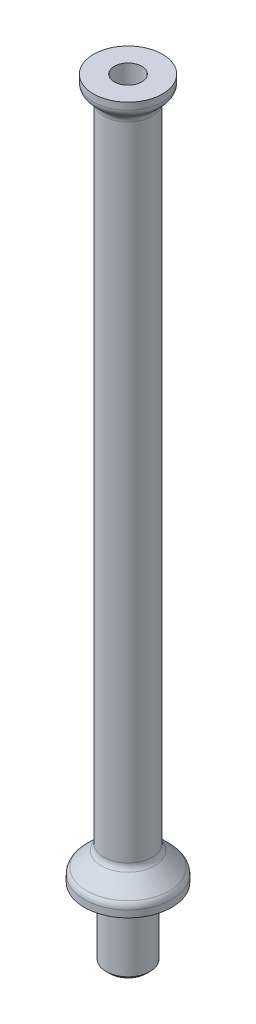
ISO-10303-21;
HEADER;
FILE_DESCRIPTION(('STEP AP214'),'2;1');
FILE_NAME('part.step','',(''),(''),'','','');
FILE_SCHEMA(('AUTOMOTIVE_DESIGN { 1 0 10303 214 1 1 1 1 }'));
ENDSEC;
DATA;
#1=APPLICATION_CONTEXT('core data for automotive mechanical design processes');
#2=APPLICATION_PROTOCOL_DEFINITION('international standard','automotive_design',2000,#1);
#3=PRODUCT_CONTEXT('',#1,'mechanical');
#4=PRODUCT('Part','Part','',(#3));
#5=PRODUCT_RELATED_PRODUCT_CATEGORY('part','',(#4));
#6=PRODUCT_DEFINITION_FORMATION('','',#4);
#7=PRODUCT_DEFINITION_CONTEXT('part definition',#1,'design');
#8=PRODUCT_DEFINITION('design','',#6,#7);
#9=PRODUCT_DEFINITION_SHAPE('','',#8);
#10=(LENGTH_UNIT() NAMED_UNIT(*) SI_UNIT(.MILLI.,.METRE.));
#11=(NAMED_UNIT(*) PLANE_ANGLE_UNIT() SI_UNIT($,.RADIAN.));
#12=(NAMED_UNIT(*) SI_UNIT($,.STERADIAN.) SOLID_ANGLE_UNIT());
#13=UNCERTAINTY_MEASURE_WITH_UNIT(LENGTH_MEASURE(1.E-05),#10,'distance_accuracy_value','');
#14=(GEOMETRIC_REPRESENTATION_CONTEXT(3) GLOBAL_UNCERTAINTY_ASSIGNED_CONTEXT((#13)) GLOBAL_UNIT_ASSIGNED_CONTEXT((#10,
#11,#12)) REPRESENTATION_CONTEXT('',''));
#15=CARTESIAN_POINT('',(0.,0.,0.));
#16=DIRECTION('',(0.,0.,1.));
#17=DIRECTION('',(1.,0.,0.));
#18=AXIS2_PLACEMENT_3D('',#15,#16,#17);
#19=CARTESIAN_POINT('',(-6.90372,0.,0.));
#20=DIRECTION('',(0.,1.,0.));
#21=DIRECTION('',(0.,0.,1.));
#22=AXIS2_PLACEMENT_3D('',#19,#20,#21);
#23=PLANE('',#22);
#24=CARTESIAN_POINT('',(0.,0.,0.));
#25=DIRECTION('',(0.,1.,0.));
#26=DIRECTION('',(0.,0.,1.));
#27=AXIS2_PLACEMENT_3D('',#24,#25,#26);
#28=CIRCLE('',#27,8.3947);
#29=CARTESIAN_POINT('',(0.,0.,8.3947));
#30=VERTEX_POINT('',#29);
#31=EDGE_CURVE('E81',#30,#30,#28,.F.);
#32=ORIENTED_EDGE('',*,*,#31,.T.);
#33=EDGE_LOOP('',(#32));
#34=FACE_BOUND('',#33,.T.);
#35=CARTESIAN_POINT('',(0.,0.,0.));
#36=DIRECTION('',(0.,-1.,0.));
#37=DIRECTION('',(0.,0.,-1.));
#38=AXIS2_PLACEMENT_3D('',#35,#36,#37);
#39=CIRCLE('',#38,6.90372);
#40=CARTESIAN_POINT('',(0.,0.,-6.90372));
#41=VERTEX_POINT('',#40);
#42=EDGE_CURVE('E93',#41,#41,#39,.T.);
#43=ORIENTED_EDGE('',*,*,#42,.F.);
#44=EDGE_LOOP('',(#43));
#45=FACE_BOUND('',#44,.T.);
#46=ADVANCED_FACE('F37',(#34,#45),#23,.F.);
#47=CARTESIAN_POINT('',(-7.9375,-25.4,0.));
#48=DIRECTION('',(0.,1.,0.));
#49=DIRECTION('',(0.,0.,1.));
#50=AXIS2_PLACEMENT_3D('',#47,#48,#49);
#51=PLANE('',#50);
#52=CARTESIAN_POINT('',(0.,-25.4,0.));
#53=DIRECTION('',(0.,1.,0.));
#54=DIRECTION('',(0.,0.,1.));
#55=AXIS2_PLACEMENT_3D('',#52,#53,#54);
#56=CIRCLE('',#55,6.66749999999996);
#57=CARTESIAN_POINT('',(0.,-25.4,6.66749999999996));
#58=VERTEX_POINT('',#57);
#59=EDGE_CURVE('E44',#58,#58,#56,.F.);
#60=ORIENTED_EDGE('',*,*,#59,.T.);
#61=EDGE_LOOP('',(#60));
#62=FACE_BOUND('',#61,.T.);
#63=CARTESIAN_POINT('',(0.,-25.4,0.));
#64=DIRECTION('',(0.,1.,0.));
#65=DIRECTION('',(0.,0.,1.));
#66=AXIS2_PLACEMENT_3D('',#63,#64,#65);
#67=CIRCLE('',#66,4.96061999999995);
#68=CARTESIAN_POINT('',(0.,-25.4,4.96061999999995));
#69=VERTEX_POINT('',#68);
#70=EDGE_CURVE('E102',#69,#69,#67,.T.);
#71=ORIENTED_EDGE('',*,*,#70,.T.);
#72=EDGE_LOOP('',(#71));
#73=FACE_BOUND('',#72,.T.);
#74=ADVANCED_FACE('F142',(#62,#73),#51,.F.);
#75=CARTESIAN_POINT('',(0.,254.,0.));
#76=DIRECTION('',(0.,-1.,0.));
#77=DIRECTION('',(0.,0.,-1.));
#78=AXIS2_PLACEMENT_3D('',#75,#76,#77);
#79=PLANE('',#78);
#80=CARTESIAN_POINT('',(0.,254.,0.));
#81=DIRECTION('',(0.,1.,0.));
#82=DIRECTION('',(0.,0.,1.));
#83=AXIS2_PLACEMENT_3D('',#80,#81,#82);
#84=CIRCLE('',#83,4.96061999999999);
#85=CARTESIAN_POINT('',(0.,254.,4.96061999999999));
#86=VERTEX_POINT('',#85);
#87=EDGE_CURVE('E105',#86,#86,#84,.T.);
#88=ORIENTED_EDGE('',*,*,#87,.F.);
#89=EDGE_LOOP('',(#88));
#90=FACE_BOUND('',#89,.T.);
#91=CARTESIAN_POINT('',(0.,254.,0.));
#92=DIRECTION('',(0.,-1.,0.));
#93=DIRECTION('',(0.,0.,-1.));
#94=AXIS2_PLACEMENT_3D('',#91,#92,#93);
#95=CIRCLE('',#94,12.5);
#96=CARTESIAN_POINT('',(0.,254.,-12.5));
#97=VERTEX_POINT('',#96);
#98=EDGE_CURVE('E87',#97,#97,#95,.T.);
#99=ORIENTED_EDGE('',*,*,#98,.F.);
#100=EDGE_LOOP('',(#99));
#101=FACE_BOUND('',#100,.T.);
#102=ADVANCED_FACE('F149',(#90,#101),#79,.F.);
#103=CARTESIAN_POINT('',(0.,0.,0.));
#104=DIRECTION('',(0.,-1.,0.));
#105=DIRECTION('',(0.,0.,-1.));
#106=AXIS2_PLACEMENT_3D('',#103,#104,#105);
#107=CYLINDRICAL_SURFACE('',#106,12.5);
#108=CARTESIAN_POINT('',(0.,251.505128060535,0.));
#109=DIRECTION('',(0.,1.,0.));
#110=DIRECTION('',(0.,0.,1.));
#111=AXIS2_PLACEMENT_3D('',#108,#109,#110);
#112=CIRCLE('',#111,12.5);
#113=CARTESIAN_POINT('',(0.,251.505128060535,12.5));
#114=VERTEX_POINT('',#113);
#115=EDGE_CURVE('E52',#114,#114,#112,.T.);
#116=ORIENTED_EDGE('',*,*,#115,.T.);
#117=EDGE_LOOP('',(#116));
#118=FACE_BOUND('',#117,.T.);
#119=ORIENTED_EDGE('',*,*,#98,.T.);
#120=EDGE_LOOP('',(#119));
#121=FACE_BOUND('',#120,.T.);
#122=ADVANCED_FACE('F218',(#118,#121),#107,.T.);
#123=CARTESIAN_POINT('',(0.,250.19,0.));
#124=DIRECTION('',(0.,1.,0.));
#125=DIRECTION('',(0.,0.,1.));
#126=AXIS2_PLACEMENT_3D('',#123,#124,#125);
#127=CONICAL_SURFACE('',#126,12.5,0.78539816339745);
#128=CARTESIAN_POINT('',(0.,247.390873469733,0.));
#129=DIRECTION('',(0.,1.,0.));
#130=DIRECTION('',(0.,0.,1.));
#131=AXIS2_PLACEMENT_3D('',#128,#129,#130);
#132=CIRCLE('',#131,9.70087346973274);
#133=CARTESIAN_POINT('',(0.,247.390873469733,9.70087346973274));
#134=VERTEX_POINT('',#133);
#135=EDGE_CURVE('E63',#134,#134,#132,.T.);
#136=ORIENTED_EDGE('',*,*,#135,.T.);
#137=EDGE_LOOP('',(#136));
#138=FACE_BOUND('',#137,.T.);
#139=CARTESIAN_POINT('',(0.,249.260064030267,0.));
#140=DIRECTION('',(0.,-1.,0.));
#141=DIRECTION('',(0.,0.,-1.));
#142=AXIS2_PLACEMENT_3D('',#139,#140,#141);
#143=CIRCLE('',#142,11.5700640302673);
#144=CARTESIAN_POINT('',(0.,249.260064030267,-11.5700640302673));
#145=VERTEX_POINT('',#144);
#146=EDGE_CURVE('E66',#145,#145,#143,.T.);
#147=ORIENTED_EDGE('',*,*,#146,.T.);
#148=EDGE_LOOP('',(#147));
#149=FACE_BOUND('',#148,.T.);
#150=ADVANCED_FACE('F212',(#138,#149),#127,.T.);
#151=CARTESIAN_POINT('',(0.,0.,0.));
#152=DIRECTION('',(0.,-1.,0.));
#153=DIRECTION('',(0.,0.,-1.));
#154=AXIS2_PLACEMENT_3D('',#151,#152,#153);
#155=CYLINDRICAL_SURFACE('',#154,8.77093750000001);
#156=CARTESIAN_POINT('',(0.,245.145809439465,0.));
#157=DIRECTION('',(0.,-1.,0.));
#158=DIRECTION('',(0.,0.,-1.));
#159=AXIS2_PLACEMENT_3D('',#156,#157,#158);
#160=CIRCLE('',#159,8.77093750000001);
#161=CARTESIAN_POINT('',(0.,245.145809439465,-8.77093750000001));
#162=VERTEX_POINT('',#161);
#163=EDGE_CURVE('E69',#162,#162,#160,.T.);
#164=ORIENTED_EDGE('',*,*,#163,.T.);
#165=EDGE_LOOP('',(#164));
#166=FACE_BOUND('',#165,.T.);
#167=CARTESIAN_POINT('',(0.,12.2291905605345,0.));
#168=DIRECTION('',(0.,-1.,0.));
#169=DIRECTION('',(0.,0.,-1.));
#170=AXIS2_PLACEMENT_3D('',#167,#168,#169);
#171=CIRCLE('',#170,8.77093750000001);
#172=CARTESIAN_POINT('',(0.,12.2291905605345,-8.77093750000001));
#173=VERTEX_POINT('',#172);
#174=EDGE_CURVE('E72',#173,#173,#171,.F.);
#175=ORIENTED_EDGE('',*,*,#174,.T.);
#176=EDGE_LOOP('',(#175));
#177=FACE_BOUND('',#176,.T.);
#178=ADVANCED_FACE('F206',(#166,#177),#155,.T.);
#179=CARTESIAN_POINT('',(0.,10.9140625,0.));
#180=DIRECTION('',(0.,-1.,0.));
#181=DIRECTION('',(0.,0.,-1.));
#182=AXIS2_PLACEMENT_3D('',#179,#180,#181);
#183=CONICAL_SURFACE('',#182,8.77093749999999,0.78539816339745);
#184=CARTESIAN_POINT('',(0.,9.98412653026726,0.));
#185=DIRECTION('',(0.,-1.,0.));
#186=DIRECTION('',(0.,0.,-1.));
#187=AXIS2_PLACEMENT_3D('',#184,#185,#186);
#188=CIRCLE('',#187,9.70087346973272);
#189=CARTESIAN_POINT('',(0.,9.98412653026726,-9.70087346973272));
#190=VERTEX_POINT('',#189);
#191=EDGE_CURVE('E57',#190,#190,#188,.T.);
#192=ORIENTED_EDGE('',*,*,#191,.T.);
#193=EDGE_LOOP('',(#192));
#194=FACE_BOUND('',#193,.T.);
#195=CARTESIAN_POINT('',(0.,4.73993596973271,0.));
#196=DIRECTION('',(0.,1.,0.));
#197=DIRECTION('',(0.,0.,1.));
#198=AXIS2_PLACEMENT_3D('',#195,#196,#197);
#199=CIRCLE('',#198,14.9450640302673);
#200=CARTESIAN_POINT('',(0.,4.73993596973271,14.9450640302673));
#201=VERTEX_POINT('',#200);
#202=EDGE_CURVE('E60',#201,#201,#199,.T.);
#203=ORIENTED_EDGE('',*,*,#202,.T.);
#204=EDGE_LOOP('',(#203));
#205=FACE_BOUND('',#204,.T.);
#206=ADVANCED_FACE('F164',(#194,#205),#183,.T.);
#207=CARTESIAN_POINT('',(0.,0.,0.));
#208=DIRECTION('',(0.,-1.,0.));
#209=DIRECTION('',(0.,0.,-1.));
#210=AXIS2_PLACEMENT_3D('',#207,#208,#209);
#211=CYLINDRICAL_SURFACE('',#210,15.875);
#212=CARTESIAN_POINT('',(0.,2.49487193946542,0.));
#213=DIRECTION('',(0.,1.,0.));
#214=DIRECTION('',(0.,0.,1.));
#215=AXIS2_PLACEMENT_3D('',#212,#213,#214);
#216=CIRCLE('',#215,15.875);
#217=CARTESIAN_POINT('',(0.,2.49487193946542,15.875));
#218=VERTEX_POINT('',#217);
#219=EDGE_CURVE('E48',#218,#218,#216,.F.);
#220=ORIENTED_EDGE('',*,*,#219,.T.);
#221=EDGE_LOOP('',(#220));
#222=FACE_BOUND('',#221,.T.);
#223=CARTESIAN_POINT('',(0.,0.,0.));
#224=DIRECTION('',(0.,-1.,0.));
#225=DIRECTION('',(0.,0.,-1.));
#226=AXIS2_PLACEMENT_3D('',#223,#224,#225);
#227=CIRCLE('',#226,15.875);
#228=CARTESIAN_POINT('',(0.,0.,-15.875));
#229=VERTEX_POINT('',#228);
#230=EDGE_CURVE('E90',#229,#229,#227,.T.);
#231=ORIENTED_EDGE('',*,*,#230,.F.);
#232=EDGE_LOOP('',(#231));
#233=FACE_BOUND('',#232,.T.);
#234=ADVANCED_FACE('F156',(#222,#233),#211,.T.);
#235=CARTESIAN_POINT('',(0.,0.,0.));
#236=DIRECTION('',(0.,1.,0.));
#237=DIRECTION('',(0.,0.,1.));
#238=AXIS2_PLACEMENT_3D('',#235,#236,#237);
#239=CIRCLE('',#238,13.2715);
#240=CARTESIAN_POINT('',(0.,0.,13.2715));
#241=VERTEX_POINT('',#240);
#242=EDGE_CURVE('E78',#241,#241,#239,.T.);
#243=ORIENTED_EDGE('',*,*,#242,.T.);
#244=EDGE_LOOP('',(#243));
#245=FACE_BOUND('',#244,.T.);
#246=ORIENTED_EDGE('',*,*,#230,.T.);
#247=EDGE_LOOP('',(#246));
#248=FACE_BOUND('',#247,.T.);
#249=ADVANCED_FACE('F145',(#245,#248),#23,.F.);
#250=CARTESIAN_POINT('',(0.,0.,0.));
#251=DIRECTION('',(0.,-1.,0.));
#252=DIRECTION('',(0.,0.,-1.));
#253=AXIS2_PLACEMENT_3D('',#250,#251,#252);
#254=CYLINDRICAL_SURFACE('',#253,6.90372);
#255=CARTESIAN_POINT('',(0.,-1.905,0.));
#256=DIRECTION('',(0.,-1.,0.));
#257=DIRECTION('',(0.,0.,-1.));
#258=AXIS2_PLACEMENT_3D('',#255,#256,#257);
#259=CIRCLE('',#258,6.90372);
#260=CARTESIAN_POINT('',(0.,-1.905,-6.90372));
#261=VERTEX_POINT('',#260);
#262=EDGE_CURVE('E96',#261,#261,#259,.T.);
#263=ORIENTED_EDGE('',*,*,#262,.F.);
#264=EDGE_LOOP('',(#263));
#265=FACE_BOUND('',#264,.T.);
#266=ORIENTED_EDGE('',*,*,#42,.T.);
#267=EDGE_LOOP('',(#266));
#268=FACE_BOUND('',#267,.T.);
#269=ADVANCED_FACE('F155',(#265,#268),#254,.T.);
#270=CARTESIAN_POINT('',(-7.9375,-1.905,0.));
#271=DIRECTION('',(0.,-1.,0.));
#272=DIRECTION('',(0.,0.,-1.));
#273=AXIS2_PLACEMENT_3D('',#270,#271,#272);
#274=PLANE('',#273);
#275=CARTESIAN_POINT('',(0.,-1.905,0.));
#276=DIRECTION('',(0.,-1.,0.));
#277=DIRECTION('',(0.,0.,-1.));
#278=AXIS2_PLACEMENT_3D('',#275,#276,#277);
#279=CIRCLE('',#278,7.9375);
#280=CARTESIAN_POINT('',(0.,-1.905,-7.9375));
#281=VERTEX_POINT('',#280);
#282=EDGE_CURVE('E99',#281,#281,#279,.T.);
#283=ORIENTED_EDGE('',*,*,#282,.F.);
#284=EDGE_LOOP('',(#283));
#285=FACE_BOUND('',#284,.T.);
#286=ORIENTED_EDGE('',*,*,#262,.T.);
#287=EDGE_LOOP('',(#286));
#288=FACE_BOUND('',#287,.T.);
#289=ADVANCED_FACE('F162',(#285,#288),#274,.F.);
#290=CARTESIAN_POINT('',(0.,0.,0.));
#291=DIRECTION('',(0.,-1.,0.));
#292=DIRECTION('',(0.,0.,-1.));
#293=AXIS2_PLACEMENT_3D('',#290,#291,#292);
#294=CYLINDRICAL_SURFACE('',#293,7.9375);
#295=CARTESIAN_POINT('',(0.,-24.13,0.));
#296=DIRECTION('',(0.,1.,0.));
#297=DIRECTION('',(0.,0.,1.));
#298=AXIS2_PLACEMENT_3D('',#295,#296,#297);
#299=CIRCLE('',#298,7.9375);
#300=CARTESIAN_POINT('',(0.,-24.13,7.9375));
#301=VERTEX_POINT('',#300);
#302=EDGE_CURVE('E10',#301,#301,#299,.T.);
#303=ORIENTED_EDGE('',*,*,#302,.T.);
#304=EDGE_LOOP('',(#303));
#305=FACE_BOUND('',#304,.T.);
#306=ORIENTED_EDGE('',*,*,#282,.T.);
#307=EDGE_LOOP('',(#306));
#308=FACE_BOUND('',#307,.T.);
#309=ADVANCED_FACE('F233',(#305,#308),#294,.T.);
#310=CARTESIAN_POINT('',(0.,254.,0.));
#311=DIRECTION('',(0.,1.,0.));
#312=DIRECTION('',(0.,0.,1.));
#313=AXIS2_PLACEMENT_3D('',#310,#311,#312);
#314=CYLINDRICAL_SURFACE('',#313,4.96061999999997);
#315=ORIENTED_EDGE('',*,*,#70,.F.);
#316=EDGE_LOOP('',(#315));
#317=FACE_BOUND('',#316,.T.);
#318=ORIENTED_EDGE('',*,*,#87,.T.);
#319=EDGE_LOOP('',(#318));
#320=FACE_BOUND('',#319,.T.);
#321=ADVANCED_FACE('F127',(#317,#320),#314,.F.);
#322=CARTESIAN_POINT('',(0.,2.1971,0.));
#323=DIRECTION('',(0.,1.,0.));
#324=DIRECTION('',(-1.,0.,0.));
#325=AXIS2_PLACEMENT_3D('',#322,#323,#324);
#326=TOROIDAL_SURFACE('',#325,8.9662,0.444499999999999);
#327=CARTESIAN_POINT('',(0.,2.6416,0.));
#328=DIRECTION('',(0.,1.,0.));
#329=DIRECTION('',(-1.,0.,0.));
#330=AXIS2_PLACEMENT_3D('',#327,#328,#329);
#331=CIRCLE('',#330,8.9662);
#332=CARTESIAN_POINT('',(-8.9662,2.6416,0.));
#333=VERTEX_POINT('',#332);
#334=EDGE_CURVE('E117',#333,#333,#331,.T.);
#335=ORIENTED_EDGE('',*,*,#334,.F.);
#336=EDGE_LOOP('',(#335));
#337=FACE_BOUND('',#336,.T.);
#338=CARTESIAN_POINT('',(0.,2.1971,0.));
#339=DIRECTION('',(0.,1.,0.));
#340=DIRECTION('',(-1.,0.,0.));
#341=AXIS2_PLACEMENT_3D('',#338,#339,#340);
#342=CIRCLE('',#341,8.5217);
#343=CARTESIAN_POINT('',(-8.5217,2.1971,0.));
#344=VERTEX_POINT('',#343);
#345=EDGE_CURVE('E108',#344,#344,#342,.T.);
#346=ORIENTED_EDGE('',*,*,#345,.T.);
#347=EDGE_LOOP('',(#346));
#348=FACE_BOUND('',#347,.T.);
#349=ADVANCED_FACE('F123',(#337,#348),#326,.F.);
#350=CARTESIAN_POINT('',(0.,0.,0.));
#351=DIRECTION('',(0.,1.,0.));
#352=DIRECTION('',(-1.,0.,0.));
#353=AXIS2_PLACEMENT_3D('',#350,#351,#352);
#354=CYLINDRICAL_SURFACE('',#353,8.5217);
#355=CARTESIAN_POINT('',(0.,0.126999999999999,0.));
#356=DIRECTION('',(0.,1.,0.));
#357=DIRECTION('',(0.,0.,1.));
#358=AXIS2_PLACEMENT_3D('',#355,#356,#357);
#359=CIRCLE('',#358,8.5217);
#360=CARTESIAN_POINT('',(0.,0.126999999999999,8.5217));
#361=VERTEX_POINT('',#360);
#362=EDGE_CURVE('E84',#361,#361,#359,.T.);
#363=ORIENTED_EDGE('',*,*,#362,.T.);
#364=EDGE_LOOP('',(#363));
#365=FACE_BOUND('',#364,.T.);
#366=ORIENTED_EDGE('',*,*,#345,.F.);
#367=EDGE_LOOP('',(#366));
#368=FACE_BOUND('',#367,.T.);
#369=ADVANCED_FACE('F126',(#365,#368),#354,.T.);
#370=CARTESIAN_POINT('',(0.,0.,0.));
#371=DIRECTION('',(0.,1.,0.));
#372=DIRECTION('',(-1.,0.,0.));
#373=AXIS2_PLACEMENT_3D('',#370,#371,#372);
#374=CYLINDRICAL_SURFACE('',#373,13.1445);
#375=CARTESIAN_POINT('',(0.,0.126999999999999,0.));
#376=DIRECTION('',(0.,1.,0.));
#377=DIRECTION('',(0.,0.,1.));
#378=AXIS2_PLACEMENT_3D('',#375,#376,#377);
#379=CIRCLE('',#378,13.1445);
#380=CARTESIAN_POINT('',(0.,0.126999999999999,13.1445));
#381=VERTEX_POINT('',#380);
#382=EDGE_CURVE('E75',#381,#381,#379,.F.);
#383=ORIENTED_EDGE('',*,*,#382,.T.);
#384=EDGE_LOOP('',(#383));
#385=FACE_BOUND('',#384,.T.);
#386=CARTESIAN_POINT('',(0.,2.1971,0.));
#387=DIRECTION('',(0.,1.,0.));
#388=DIRECTION('',(-1.,0.,0.));
#389=AXIS2_PLACEMENT_3D('',#386,#387,#388);
#390=CIRCLE('',#389,13.1445);
#391=CARTESIAN_POINT('',(-13.1445,2.1971,0.));
#392=VERTEX_POINT('',#391);
#393=EDGE_CURVE('E111',#392,#392,#390,.T.);
#394=ORIENTED_EDGE('',*,*,#393,.T.);
#395=EDGE_LOOP('',(#394));
#396=FACE_BOUND('',#395,.T.);
#397=ADVANCED_FACE('F132',(#385,#396),#374,.F.);
#398=CARTESIAN_POINT('',(0.,2.1971,0.));
#399=DIRECTION('',(0.,1.,0.));
#400=DIRECTION('',(-1.,0.,0.));
#401=AXIS2_PLACEMENT_3D('',#398,#399,#400);
#402=TOROIDAL_SURFACE('',#401,12.7,0.444499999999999);
#403=ORIENTED_EDGE('',*,*,#393,.F.);
#404=EDGE_LOOP('',(#403));
#405=FACE_BOUND('',#404,.T.);
#406=CARTESIAN_POINT('',(0.,2.6416,0.));
#407=DIRECTION('',(0.,1.,0.));
#408=DIRECTION('',(-1.,0.,0.));
#409=AXIS2_PLACEMENT_3D('',#406,#407,#408);
#410=CIRCLE('',#409,12.7);
#411=CARTESIAN_POINT('',(-12.7,2.6416,0.));
#412=VERTEX_POINT('',#411);
#413=EDGE_CURVE('E114',#412,#412,#410,.T.);
#414=ORIENTED_EDGE('',*,*,#413,.T.);
#415=EDGE_LOOP('',(#414));
#416=FACE_BOUND('',#415,.T.);
#417=ADVANCED_FACE('F138',(#405,#416),#402,.F.);
#418=CARTESIAN_POINT('',(-12.7,2.6416,0.));
#419=DIRECTION('',(0.,1.,0.));
#420=DIRECTION('',(-1.,0.,0.));
#421=AXIS2_PLACEMENT_3D('',#418,#419,#420);
#422=PLANE('',#421);
#423=ORIENTED_EDGE('',*,*,#413,.F.);
#424=EDGE_LOOP('',(#423));
#425=FACE_BOUND('',#424,.T.);
#426=ORIENTED_EDGE('',*,*,#334,.T.);
#427=EDGE_LOOP('',(#426));
#428=FACE_BOUND('',#427,.T.);
#429=ADVANCED_FACE('F121',(#425,#428),#422,.F.);
#430=CARTESIAN_POINT('',(0.,0.126999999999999,0.));
#431=DIRECTION('',(0.,1.,0.));
#432=DIRECTION('',(0.,0.,1.));
#433=AXIS2_PLACEMENT_3D('',#430,#431,#432);
#434=TOROIDAL_SURFACE('',#433,8.3947,0.127);
#435=ORIENTED_EDGE('',*,*,#31,.F.);
#436=EDGE_LOOP('',(#435));
#437=FACE_BOUND('',#436,.T.);
#438=ORIENTED_EDGE('',*,*,#362,.F.);
#439=EDGE_LOOP('',(#438));
#440=FACE_BOUND('',#439,.T.);
#441=ADVANCED_FACE('F174',(#437,#440),#434,.T.);
#442=CARTESIAN_POINT('',(0.,0.126999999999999,0.));
#443=DIRECTION('',(0.,1.,0.));
#444=DIRECTION('',(0.,0.,1.));
#445=AXIS2_PLACEMENT_3D('',#442,#443,#444);
#446=TOROIDAL_SURFACE('',#445,13.2715,0.127);
#447=ORIENTED_EDGE('',*,*,#382,.F.);
#448=EDGE_LOOP('',(#447));
#449=FACE_BOUND('',#448,.T.);
#450=ORIENTED_EDGE('',*,*,#242,.F.);
#451=EDGE_LOOP('',(#450));
#452=FACE_BOUND('',#451,.T.);
#453=ADVANCED_FACE('F171',(#449,#452),#446,.T.);
#454=CARTESIAN_POINT('',(0.,245.145809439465,0.));
#455=DIRECTION('',(0.,-1.,0.));
#456=DIRECTION('',(0.,0.,-1.));
#457=AXIS2_PLACEMENT_3D('',#454,#455,#456);
#458=TOROIDAL_SURFACE('',#457,11.9459375,3.175);
#459=ORIENTED_EDGE('',*,*,#135,.F.);
#460=EDGE_LOOP('',(#459));
#461=FACE_BOUND('',#460,.T.);
#462=ORIENTED_EDGE('',*,*,#163,.F.);
#463=EDGE_LOOP('',(#462));
#464=FACE_BOUND('',#463,.T.);
#465=ADVANCED_FACE('F173',(#461,#464),#458,.F.);
#466=CARTESIAN_POINT('',(0.,12.2291905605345,0.));
#467=DIRECTION('',(0.,-1.,0.));
#468=DIRECTION('',(0.,0.,-1.));
#469=AXIS2_PLACEMENT_3D('',#466,#467,#468);
#470=TOROIDAL_SURFACE('',#469,11.9459375,3.175);
#471=ORIENTED_EDGE('',*,*,#174,.F.);
#472=EDGE_LOOP('',(#471));
#473=FACE_BOUND('',#472,.T.);
#474=ORIENTED_EDGE('',*,*,#191,.F.);
#475=EDGE_LOOP('',(#474));
#476=FACE_BOUND('',#475,.T.);
#477=ADVANCED_FACE('F181',(#473,#476),#470,.F.);
#478=CARTESIAN_POINT('',(0.,251.505128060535,0.));
#479=DIRECTION('',(0.,1.,0.));
#480=DIRECTION('',(0.,0.,1.));
#481=AXIS2_PLACEMENT_3D('',#478,#479,#480);
#482=TOROIDAL_SURFACE('',#481,9.32500000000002,3.175);
#483=ORIENTED_EDGE('',*,*,#115,.F.);
#484=EDGE_LOOP('',(#483));
#485=FACE_BOUND('',#484,.T.);
#486=ORIENTED_EDGE('',*,*,#146,.F.);
#487=EDGE_LOOP('',(#486));
#488=FACE_BOUND('',#487,.T.);
#489=ADVANCED_FACE('F190',(#485,#488),#482,.T.);
#490=CARTESIAN_POINT('',(0.,2.49487193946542,0.));
#491=DIRECTION('',(0.,1.,0.));
#492=DIRECTION('',(0.,0.,1.));
#493=AXIS2_PLACEMENT_3D('',#490,#491,#492);
#494=TOROIDAL_SURFACE('',#493,12.7,3.175);
#495=ORIENTED_EDGE('',*,*,#202,.F.);
#496=EDGE_LOOP('',(#495));
#497=FACE_BOUND('',#496,.T.);
#498=ORIENTED_EDGE('',*,*,#219,.F.);
#499=EDGE_LOOP('',(#498));
#500=FACE_BOUND('',#499,.T.);
#501=ADVANCED_FACE('F193',(#497,#500),#494,.T.);
#502=CARTESIAN_POINT('',(0.,-25.4,0.));
#503=DIRECTION('',(0.,1.,0.));
#504=DIRECTION('',(0.,0.,1.));
#505=AXIS2_PLACEMENT_3D('',#502,#503,#504);
#506=CONICAL_SURFACE('',#505,6.66749999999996,0.785398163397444);
#507=ORIENTED_EDGE('',*,*,#302,.F.);
#508=EDGE_LOOP('',(#507));
#509=FACE_BOUND('',#508,.T.);
#510=ORIENTED_EDGE('',*,*,#59,.F.);
#511=EDGE_LOOP('',(#510));
#512=FACE_BOUND('',#511,.T.);
#513=ADVANCED_FACE('F39',(#509,#512),#506,.T.);
#514=CLOSED_SHELL('',(#46,#74,#102,#122,#150,#178,#206,#234,#249,#269,#289,#309,#321,#349,#369,
#397,#417,#429,#441,#453,#465,#477,#489,#501,#513));
#515=MANIFOLD_SOLID_BREP('B2',#514);
#516=ADVANCED_BREP_SHAPE_REPRESENTATION('',(#18,#515),#14);
#517=SHAPE_DEFINITION_REPRESENTATION(#9,#516);
ENDSEC;
END-ISO-10303-21;
